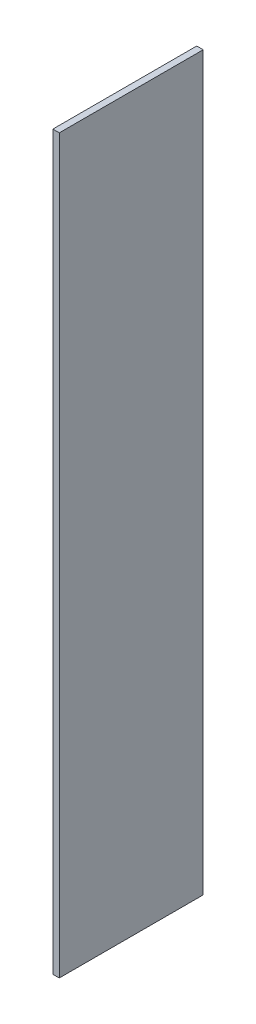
from build123d import *

# Parameters (mm, degrees)
SKETCH1_W           = 56.4388
SKETCH1_H           = 287.02
BOSS_EXTRUDE1_DEPTH = 2.54


with BuildPart() as part:
    # Sketch1 → Boss-Extrude1 (new body)
    with BuildSketch(Plane(origin=(0, 0, 0), x_dir=(0, 0, -1), z_dir=(1, 0, 0))):
        Rectangle(SKETCH1_W, SKETCH1_H)
    extrude(amount=BOSS_EXTRUDE1_DEPTH)


solid = part.part
